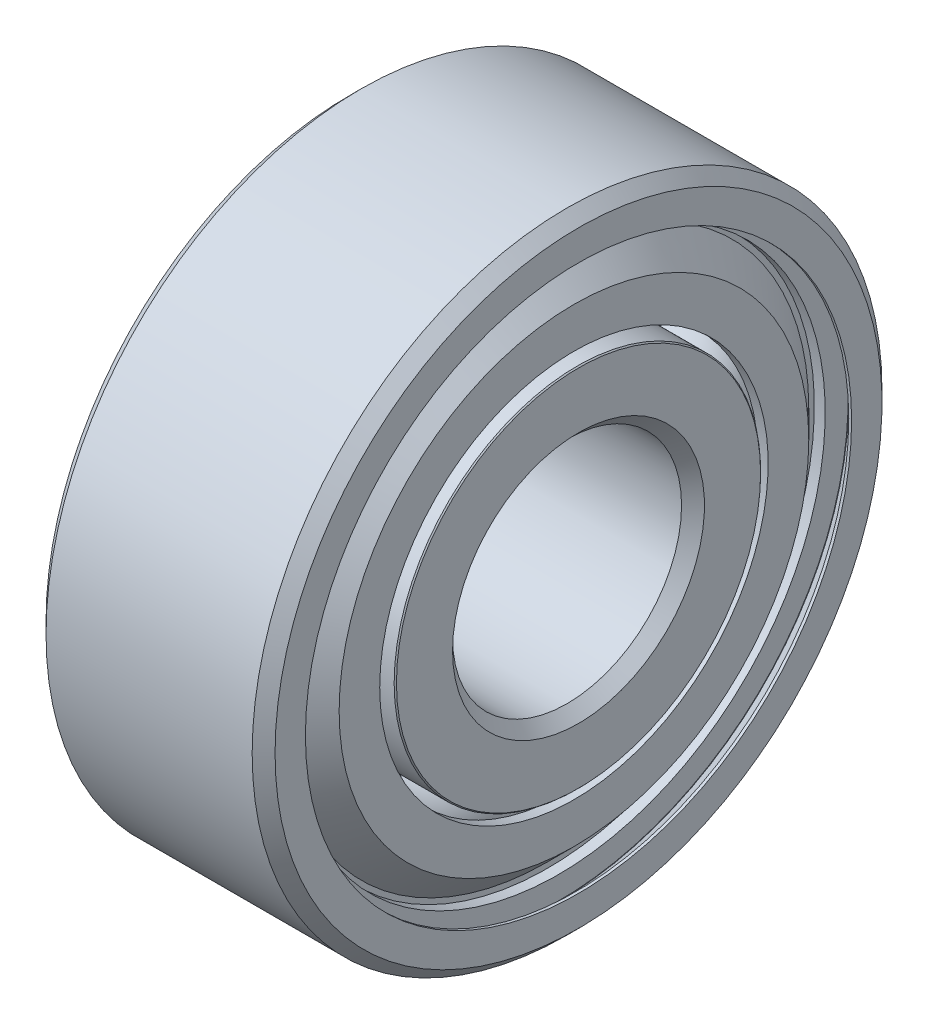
from build123d import *
from build123d.topology import SkipClean

# Parameters (mm, degrees)
SKETCH1_4_W       = 0.19
SKETCH1_4_H       = 0.4
CIRPATTERN2_COUNT = 8


with BuildPart() as part:
    # Sketch1 → Revolve1 (revolve)
    with BuildSketch(Plane.XY, mode=Mode.PRIVATE) as revolve1_sk:
        with BuildLine():
            ThreePointArc((1.00871205, 4.5), (0, 5.05), (-1.00871205, 4.5))
            Line((-1.00871205, 4.5), (-1.25, 4.5))
            Line((-1.25, 4.5), (-1.25, 4.77))
            Line((-1.25, 4.77), (-1.45, 4.77))
            Line((-1.45, 4.77), (-1.45, 5.07))
            Line((-1.45, 5.07), (-1.65, 5.07))
            Line((-1.65, 5.07), (-1.95, 4.77))
            Line((-1.95, 4.77), (-2, 4.77))
            Line((-2, 4.77), (-2, 5.3))
            Line((-2, 5.3), (-1.8, 5.5))
            Line((-1.8, 5.5), (1.8, 5.5))
            Line((1.8, 5.5), (2, 5.3))
            Line((2, 5.3), (2, 4.77))
            Line((2, 4.77), (1.95, 4.77))
            Line((1.95, 4.77), (1.65, 5.07))
            Line((1.65, 5.07), (1.45, 5.07))
            Line((1.45, 5.07), (1.45, 4.77))
            Line((1.45, 4.77), (1.25, 4.77))
            Line((1.25, 4.77), (1.25, 4.5))
            Line((1.25, 4.5), (1.00871205, 4.5))
        make_face()
        with BuildLine():
            ThreePointArc((-1.00871205, 3.2), (0, 2.65), (1.00871205, 3.2))
            Line((1.00871205, 3.2), (1.98, 3.2))
            Line((1.98, 3.2), (2, 3.18))
            Line((2, 3.18), (2, 2.2))
            Line((2, 2.2), (1.8, 2))
            Line((1.8, 2), (-1.8, 2))
            Line((-1.8, 2), (-2, 2.2))
            Line((-2, 2.2), (-2, 3.18))
            Line((-2, 3.18), (-1.98, 3.2))
            Line((-1.98, 3.2), (-1.00871205, 3.2))
        make_face()
    revolve(revolve1_sk.sketch.rotate(Axis((0, 0, 0), (1, 0, 0)), 90), axis=Axis((0, 0, 0), (1, 0, 0)))


with BuildPart() as body_2:
    # Sketch1_3 → Revolve2 (revolve)
    with BuildSketch(Plane.XY, mode=Mode.PRIVATE) as revolve2_sk:
        Polygon((1.92036514, 4.101237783), (1.92036514, 3.392543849), (1.74036514, 3.392543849), (1.74036514, 4.026679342), (1.267044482, 4.5), (1.267044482, 4.756515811), (1.447044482, 4.756515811), (1.447044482, 4.574558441), align=None)
        Polygon((-1.267044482, 4.5), (-1.267044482, 4.756515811), (-1.447044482, 4.756515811), (-1.447044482, 4.574558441), (-1.92036514, 4.101237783), (-1.92036514, 3.392543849), (-1.74036514, 3.392543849), (-1.74036514, 4.026679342), align=None)
    revolve(revolve2_sk.sketch.rotate(Axis((0, 0, 0), (1, 0, 0)), 90), axis=Axis((0, 0, 0), (1, 0, 0)))


with BuildPart() as body_3:
    # Sketch1_4 → Revolve3 (revolve)
    with BuildSketch(Plane.XY, mode=Mode.PRIVATE) as revolve3_sk:
        with Locations((1.553908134, 4.860421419)):
            Rectangle(SKETCH1_4_W, SKETCH1_4_H)
        with Locations((-1.553908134, 4.860421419)):
            Rectangle(SKETCH1_4_W, SKETCH1_4_H)
    revolve(revolve3_sk.sketch.rotate(Axis((0, 0, 0), (1, 0, 0)), 90), axis=Axis((0, 0, 0), (1, 0, 0)))


with BuildPart() as body_4:
    # Sketch1_5 → Revolve4 (revolve)
    with SkipClean():  # the faces are left unmerged after this step: merging them gives an invalid solid
        with BuildSketch(Plane.XY):
            with BuildLine():
                ThreePointArc((1.15, 3.85), (0.813172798, 4.663172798), (0, 5))
                Line((0, 5), (0, 2.7))
                ThreePointArc((0, 2.7), (0.813172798, 3.036827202), (1.15, 3.85))
            make_face()
            with BuildLine():
                Line((0, 2.7), (0, 5))
                ThreePointArc((0, 5), (-1.15, 3.85), (0, 2.7))
            make_face()
        revolve(axis=Axis((0, 5, 0), (0, -1, 0)))


with BuildPart() as cirpattern2_1:
    # CirPattern2: pattern copy
    add(body_4.part.rotate(Axis((0, 0, 0), (1, 0, 0)), 1 * 360 / CIRPATTERN2_COUNT))


with BuildPart() as cirpattern2_2:
    # CirPattern2: pattern copy
    add(body_4.part.rotate(Axis((0, 0, 0), (1, 0, 0)), 2 * 360 / CIRPATTERN2_COUNT))


with BuildPart() as cirpattern2_3:
    # CirPattern2: pattern copy
    add(body_4.part.rotate(Axis((0, 0, 0), (1, 0, 0)), 3 * 360 / CIRPATTERN2_COUNT))


with BuildPart() as cirpattern2_4:
    # CirPattern2: pattern copy
    add(body_4.part.rotate(Axis((0, 0, 0), (1, 0, 0)), 4 * 360 / CIRPATTERN2_COUNT))


with BuildPart() as cirpattern2_5:
    # CirPattern2: pattern copy
    add(body_4.part.rotate(Axis((0, 0, 0), (1, 0, 0)), 5 * 360 / CIRPATTERN2_COUNT))


with BuildPart() as cirpattern2_6:
    # CirPattern2: pattern copy
    add(body_4.part.rotate(Axis((0, 0, 0), (1, 0, 0)), 6 * 360 / CIRPATTERN2_COUNT))


with BuildPart() as cirpattern2_7:
    # CirPattern2: pattern copy
    add(body_4.part.rotate(Axis((0, 0, 0), (1, 0, 0)), 7 * 360 / CIRPATTERN2_COUNT))


solid = Compound([part.part, body_2.part, body_3.part, body_4.part, cirpattern2_1.part, cirpattern2_2.part, cirpattern2_3.part, cirpattern2_4.part, cirpattern2_5.part, cirpattern2_6.part, cirpattern2_7.part])
